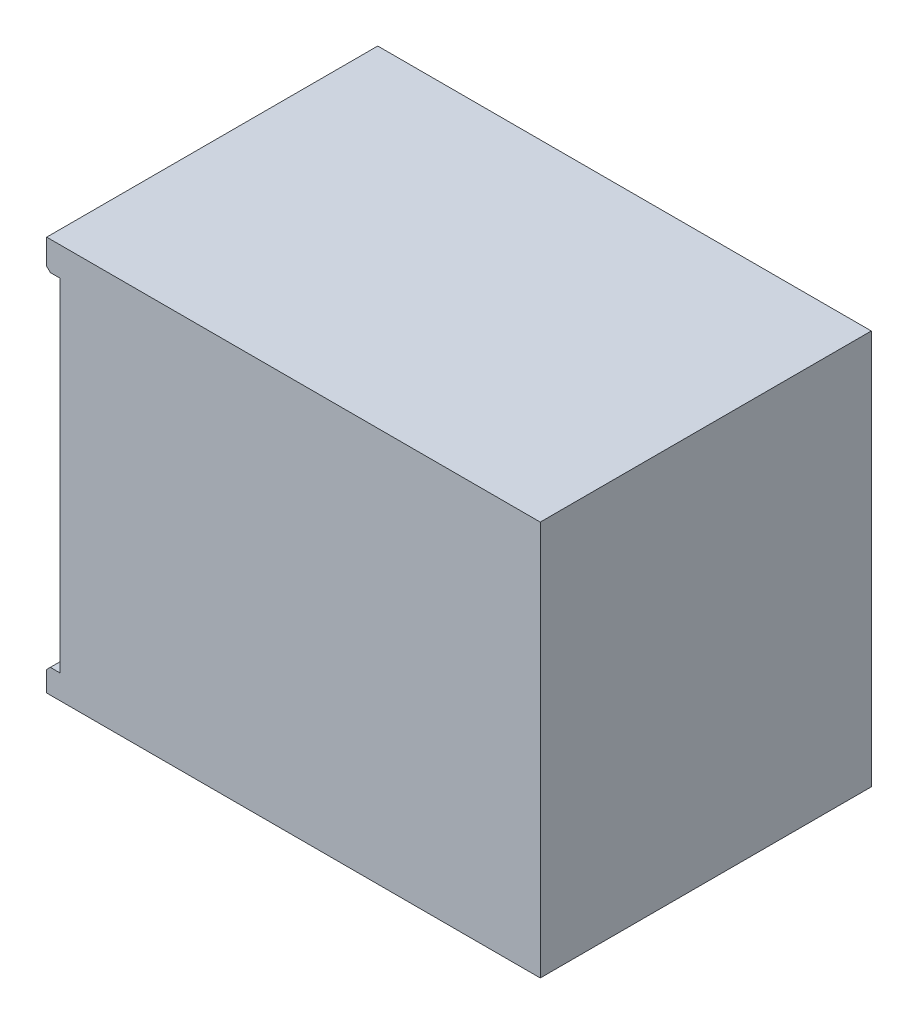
ISO-10303-21;
HEADER;
FILE_DESCRIPTION(('STEP AP214'),'2;1');
FILE_NAME('part.step','',(''),(''),'','','');
FILE_SCHEMA(('AUTOMOTIVE_DESIGN { 1 0 10303 214 1 1 1 1 }'));
ENDSEC;
DATA;
#1=APPLICATION_CONTEXT('core data for automotive mechanical design processes');
#2=APPLICATION_PROTOCOL_DEFINITION('international standard','automotive_design',2000,#1);
#3=PRODUCT_CONTEXT('',#1,'mechanical');
#4=PRODUCT('Part','Part','',(#3));
#5=PRODUCT_RELATED_PRODUCT_CATEGORY('part','',(#4));
#6=PRODUCT_DEFINITION_FORMATION('','',#4);
#7=PRODUCT_DEFINITION_CONTEXT('part definition',#1,'design');
#8=PRODUCT_DEFINITION('design','',#6,#7);
#9=PRODUCT_DEFINITION_SHAPE('','',#8);
#10=(LENGTH_UNIT() NAMED_UNIT(*) SI_UNIT(.MILLI.,.METRE.));
#11=(NAMED_UNIT(*) PLANE_ANGLE_UNIT() SI_UNIT($,.RADIAN.));
#12=(NAMED_UNIT(*) SI_UNIT($,.STERADIAN.) SOLID_ANGLE_UNIT());
#13=UNCERTAINTY_MEASURE_WITH_UNIT(LENGTH_MEASURE(1.E-05),#10,'distance_accuracy_value','');
#14=(GEOMETRIC_REPRESENTATION_CONTEXT(3) GLOBAL_UNCERTAINTY_ASSIGNED_CONTEXT((#13)) GLOBAL_UNIT_ASSIGNED_CONTEXT((#10,
#11,#12)) REPRESENTATION_CONTEXT('',''));
#15=CARTESIAN_POINT('',(0.,0.,0.));
#16=DIRECTION('',(0.,0.,1.));
#17=DIRECTION('',(1.,0.,0.));
#18=AXIS2_PLACEMENT_3D('',#15,#16,#17);
#19=CARTESIAN_POINT('',(-1.397,0.,17.4625));
#20=DIRECTION('',(0.,-1.,0.));
#21=DIRECTION('',(0.,0.,-1.));
#22=AXIS2_PLACEMENT_3D('',#19,#20,#21);
#23=PLANE('',#22);
#24=DIRECTION('',(-1.,0.,0.));
#25=VECTOR('',#24,1.);
#26=CARTESIAN_POINT('',(-1.397,0.,-17.4625));
#27=LINE('',#26,#25);
#28=CARTESIAN_POINT('',(50.673,0.,-17.4625));
#29=VERTEX_POINT('',#28);
#30=CARTESIAN_POINT('',(-1.397,0.,-17.4625));
#31=VERTEX_POINT('',#30);
#32=EDGE_CURVE('E150',#29,#31,#27,.T.);
#33=ORIENTED_EDGE('',*,*,#32,.T.);
#34=DIRECTION('',(0.,0.,-1.));
#35=VECTOR('',#34,1.);
#36=CARTESIAN_POINT('',(-1.397,0.,17.4625));
#37=LINE('',#36,#35);
#38=CARTESIAN_POINT('',(-1.397,0.,17.4625));
#39=VERTEX_POINT('',#38);
#40=EDGE_CURVE('E201',#39,#31,#37,.T.);
#41=ORIENTED_EDGE('',*,*,#40,.F.);
#42=DIRECTION('',(-1.,0.,0.));
#43=VECTOR('',#42,1.);
#44=CARTESIAN_POINT('',(-1.397,0.,17.4625));
#45=LINE('',#44,#43);
#46=CARTESIAN_POINT('',(50.673,0.,17.4625));
#47=VERTEX_POINT('',#46);
#48=EDGE_CURVE('E151',#47,#39,#45,.T.);
#49=ORIENTED_EDGE('',*,*,#48,.F.);
#50=DIRECTION('',(0.,0.,-1.));
#51=VECTOR('',#50,1.);
#52=CARTESIAN_POINT('',(50.673,0.,17.4625));
#53=LINE('',#52,#51);
#54=EDGE_CURVE('E170',#47,#29,#53,.T.);
#55=ORIENTED_EDGE('',*,*,#54,.T.);
#56=EDGE_LOOP('',(#33,#41,#49,#55));
#57=FACE_BOUND('',#56,.T.);
#58=ADVANCED_FACE('F37',(#57),#23,.F.);
#59=CARTESIAN_POINT('',(-1.397,-3.048,17.4625));
#60=DIRECTION('',(1.,0.,0.));
#61=DIRECTION('',(0.,0.,-1.));
#62=AXIS2_PLACEMENT_3D('',#59,#60,#61);
#63=PLANE('',#62);
#64=DIRECTION('',(0.,-1.,0.));
#65=VECTOR('',#64,1.);
#66=CARTESIAN_POINT('',(-1.397,-3.048,-17.4625));
#67=LINE('',#66,#65);
#68=CARTESIAN_POINT('',(-1.397,-2.667,-17.4625));
#69=VERTEX_POINT('',#68);
#70=EDGE_CURVE('E173',#31,#69,#67,.T.);
#71=ORIENTED_EDGE('',*,*,#70,.T.);
#72=DIRECTION('',(0.,0.,1.));
#73=VECTOR('',#72,1.);
#74=CARTESIAN_POINT('',(-1.397,-2.667,17.4625));
#75=LINE('',#74,#73);
#76=CARTESIAN_POINT('',(-1.397,-2.667,17.4625));
#77=VERTEX_POINT('',#76);
#78=EDGE_CURVE('E11',#69,#77,#75,.T.);
#79=ORIENTED_EDGE('',*,*,#78,.T.);
#80=DIRECTION('',(0.,-1.,0.));
#81=VECTOR('',#80,1.);
#82=CARTESIAN_POINT('',(-1.397,-3.048,17.4625));
#83=LINE('',#82,#81);
#84=EDGE_CURVE('E154',#39,#77,#83,.T.);
#85=ORIENTED_EDGE('',*,*,#84,.F.);
#86=ORIENTED_EDGE('',*,*,#40,.T.);
#87=EDGE_LOOP('',(#71,#79,#85,#86));
#88=FACE_BOUND('',#87,.T.);
#89=ADVANCED_FACE('F257',(#88),#63,.F.);
#90=CARTESIAN_POINT('',(0.,-3.048,17.4625));
#91=DIRECTION('',(0.,1.,0.));
#92=DIRECTION('',(0.,0.,1.));
#93=AXIS2_PLACEMENT_3D('',#90,#91,#92);
#94=PLANE('',#93);
#95=DIRECTION('',(1.,0.,0.));
#96=VECTOR('',#95,1.);
#97=CARTESIAN_POINT('',(0.,-3.048,17.4625));
#98=LINE('',#97,#96);
#99=CARTESIAN_POINT('',(-1.016,-3.048,17.4625));
#100=VERTEX_POINT('',#99);
#101=CARTESIAN_POINT('',(0.,-3.048,17.4625));
#102=VERTEX_POINT('',#101);
#103=EDGE_CURVE('E157',#100,#102,#98,.T.);
#104=ORIENTED_EDGE('',*,*,#103,.F.);
#105=DIRECTION('',(0.,0.,-1.));
#106=VECTOR('',#105,1.);
#107=CARTESIAN_POINT('',(-1.016,-3.048,17.4625));
#108=LINE('',#107,#106);
#109=CARTESIAN_POINT('',(-1.016,-3.048,-17.4625));
#110=VERTEX_POINT('',#109);
#111=EDGE_CURVE('E45',#100,#110,#108,.T.);
#112=ORIENTED_EDGE('',*,*,#111,.T.);
#113=DIRECTION('',(1.,0.,0.));
#114=VECTOR('',#113,1.);
#115=CARTESIAN_POINT('',(0.,-3.048,-17.4625));
#116=LINE('',#115,#114);
#117=CARTESIAN_POINT('',(0.,-3.048,-17.4625));
#118=VERTEX_POINT('',#117);
#119=EDGE_CURVE('E175',#110,#118,#116,.T.);
#120=ORIENTED_EDGE('',*,*,#119,.T.);
#121=DIRECTION('',(0.,0.,-1.));
#122=VECTOR('',#121,1.);
#123=CARTESIAN_POINT('',(0.,-3.048,17.4625));
#124=LINE('',#123,#122);
#125=EDGE_CURVE('E198',#102,#118,#124,.T.);
#126=ORIENTED_EDGE('',*,*,#125,.F.);
#127=EDGE_LOOP('',(#104,#112,#120,#126));
#128=FACE_BOUND('',#127,.T.);
#129=ADVANCED_FACE('F219',(#128),#94,.F.);
#130=CARTESIAN_POINT('',(0.,-39.116,17.4625));
#131=DIRECTION('',(1.,0.,0.));
#132=DIRECTION('',(0.,0.,-1.));
#133=AXIS2_PLACEMENT_3D('',#130,#131,#132);
#134=PLANE('',#133);
#135=CARTESIAN_POINT('',(0.,-29.21,-13.97));
#136=DIRECTION('',(-1.,0.,0.));
#137=DIRECTION('',(0.,0.,1.));
#138=AXIS2_PLACEMENT_3D('',#135,#136,#137);
#139=CIRCLE('',#138,1.7526);
#140=CARTESIAN_POINT('',(0.,-29.21,-12.2174));
#141=VERTEX_POINT('',#140);
#142=EDGE_CURVE('E135',#141,#141,#139,.T.);
#143=ORIENTED_EDGE('',*,*,#142,.F.);
#144=EDGE_LOOP('',(#143));
#145=FACE_BOUND('',#144,.T.);
#146=CARTESIAN_POINT('',(0.,-12.446,13.97));
#147=DIRECTION('',(-1.,0.,0.));
#148=DIRECTION('',(0.,0.,1.));
#149=AXIS2_PLACEMENT_3D('',#146,#147,#148);
#150=CIRCLE('',#149,1.7526);
#151=CARTESIAN_POINT('',(0.,-12.446,15.7226));
#152=VERTEX_POINT('',#151);
#153=EDGE_CURVE('E147',#152,#152,#150,.T.);
#154=ORIENTED_EDGE('',*,*,#153,.F.);
#155=EDGE_LOOP('',(#154));
#156=FACE_BOUND('',#155,.T.);
#157=DIRECTION('',(0.,-1.,0.));
#158=VECTOR('',#157,1.);
#159=CARTESIAN_POINT('',(0.,-39.116,-17.4625));
#160=LINE('',#159,#158);
#161=CARTESIAN_POINT('',(0.,-39.116,-17.4625));
#162=VERTEX_POINT('',#161);
#163=EDGE_CURVE('E177',#118,#162,#160,.T.);
#164=ORIENTED_EDGE('',*,*,#163,.T.);
#165=DIRECTION('',(0.,0.,-1.));
#166=VECTOR('',#165,1.);
#167=CARTESIAN_POINT('',(0.,-39.116,17.4625));
#168=LINE('',#167,#166);
#169=CARTESIAN_POINT('',(0.,-39.116,17.4625));
#170=VERTEX_POINT('',#169);
#171=EDGE_CURVE('E195',#170,#162,#168,.T.);
#172=ORIENTED_EDGE('',*,*,#171,.F.);
#173=DIRECTION('',(0.,-1.,0.));
#174=VECTOR('',#173,1.);
#175=CARTESIAN_POINT('',(0.,-39.116,17.4625));
#176=LINE('',#175,#174);
#177=EDGE_CURVE('E159',#102,#170,#176,.T.);
#178=ORIENTED_EDGE('',*,*,#177,.F.);
#179=ORIENTED_EDGE('',*,*,#125,.T.);
#180=EDGE_LOOP('',(#164,#172,#178,#179));
#181=FACE_BOUND('',#180,.T.);
#182=ADVANCED_FACE('F229',(#145,#156,#181),#134,.F.);
#183=CARTESIAN_POINT('',(-1.39700000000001,-39.116,17.4625));
#184=DIRECTION('',(0.,-1.,0.));
#185=DIRECTION('',(0.,0.,-1.));
#186=AXIS2_PLACEMENT_3D('',#183,#184,#185);
#187=PLANE('',#186);
#188=DIRECTION('',(-1.,0.,0.));
#189=VECTOR('',#188,1.);
#190=CARTESIAN_POINT('',(-1.39700000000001,-39.116,-17.4625));
#191=LINE('',#190,#189);
#192=CARTESIAN_POINT('',(-1.01600000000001,-39.116,-17.4625));
#193=VERTEX_POINT('',#192);
#194=EDGE_CURVE('E179',#162,#193,#191,.T.);
#195=ORIENTED_EDGE('',*,*,#194,.T.);
#196=DIRECTION('',(0.,0.,1.));
#197=VECTOR('',#196,1.);
#198=CARTESIAN_POINT('',(-1.01600000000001,-39.116,17.4625));
#199=LINE('',#198,#197);
#200=CARTESIAN_POINT('',(-1.01600000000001,-39.116,17.4625));
#201=VERTEX_POINT('',#200);
#202=EDGE_CURVE('E211',#193,#201,#199,.T.);
#203=ORIENTED_EDGE('',*,*,#202,.T.);
#204=DIRECTION('',(-1.,0.,0.));
#205=VECTOR('',#204,1.);
#206=CARTESIAN_POINT('',(-1.39700000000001,-39.116,17.4625));
#207=LINE('',#206,#205);
#208=EDGE_CURVE('E161',#170,#201,#207,.T.);
#209=ORIENTED_EDGE('',*,*,#208,.F.);
#210=ORIENTED_EDGE('',*,*,#171,.T.);
#211=EDGE_LOOP('',(#195,#203,#209,#210));
#212=FACE_BOUND('',#211,.T.);
#213=ADVANCED_FACE('F233',(#212),#187,.F.);
#214=CARTESIAN_POINT('',(-1.39700000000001,-41.656,17.4625));
#215=DIRECTION('',(1.,0.,0.));
#216=DIRECTION('',(0.,1.,0.));
#217=AXIS2_PLACEMENT_3D('',#214,#215,#216);
#218=PLANE('',#217);
#219=DIRECTION('',(0.,-1.,0.));
#220=VECTOR('',#219,1.);
#221=CARTESIAN_POINT('',(-1.39700000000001,-41.656,17.4625));
#222=LINE('',#221,#220);
#223=CARTESIAN_POINT('',(-1.39700000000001,-39.497,17.4625));
#224=VERTEX_POINT('',#223);
#225=CARTESIAN_POINT('',(-1.39700000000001,-41.656,17.4625));
#226=VERTEX_POINT('',#225);
#227=EDGE_CURVE('E164',#224,#226,#222,.T.);
#228=ORIENTED_EDGE('',*,*,#227,.F.);
#229=DIRECTION('',(0.,0.,-1.));
#230=VECTOR('',#229,1.);
#231=CARTESIAN_POINT('',(-1.39700000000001,-39.497,17.4625));
#232=LINE('',#231,#230);
#233=CARTESIAN_POINT('',(-1.39700000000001,-39.497,-17.4625));
#234=VERTEX_POINT('',#233);
#235=EDGE_CURVE('E204',#224,#234,#232,.T.);
#236=ORIENTED_EDGE('',*,*,#235,.T.);
#237=DIRECTION('',(0.,-1.,0.));
#238=VECTOR('',#237,1.);
#239=CARTESIAN_POINT('',(-1.39700000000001,-41.656,-17.4625));
#240=LINE('',#239,#238);
#241=CARTESIAN_POINT('',(-1.39700000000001,-41.656,-17.4625));
#242=VERTEX_POINT('',#241);
#243=EDGE_CURVE('E182',#234,#242,#240,.T.);
#244=ORIENTED_EDGE('',*,*,#243,.T.);
#245=DIRECTION('',(0.,0.,-1.));
#246=VECTOR('',#245,1.);
#247=CARTESIAN_POINT('',(-1.39700000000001,-41.656,17.4625));
#248=LINE('',#247,#246);
#249=EDGE_CURVE('E192',#226,#242,#248,.T.);
#250=ORIENTED_EDGE('',*,*,#249,.F.);
#251=EDGE_LOOP('',(#228,#236,#244,#250));
#252=FACE_BOUND('',#251,.T.);
#253=ADVANCED_FACE('F241',(#252),#218,.F.);
#254=CARTESIAN_POINT('',(50.673,-41.656,17.4625));
#255=DIRECTION('',(0.,1.,0.));
#256=DIRECTION('',(-1.,0.,0.));
#257=AXIS2_PLACEMENT_3D('',#254,#255,#256);
#258=PLANE('',#257);
#259=DIRECTION('',(1.,0.,0.));
#260=VECTOR('',#259,1.);
#261=CARTESIAN_POINT('',(50.673,-41.656,-17.4625));
#262=LINE('',#261,#260);
#263=CARTESIAN_POINT('',(50.673,-41.656,-17.4625));
#264=VERTEX_POINT('',#263);
#265=EDGE_CURVE('E184',#242,#264,#262,.T.);
#266=ORIENTED_EDGE('',*,*,#265,.T.);
#267=DIRECTION('',(0.,0.,-1.));
#268=VECTOR('',#267,1.);
#269=CARTESIAN_POINT('',(50.673,-41.656,17.4625));
#270=LINE('',#269,#268);
#271=CARTESIAN_POINT('',(50.673,-41.656,17.4625));
#272=VERTEX_POINT('',#271);
#273=EDGE_CURVE('E189',#272,#264,#270,.T.);
#274=ORIENTED_EDGE('',*,*,#273,.F.);
#275=DIRECTION('',(1.,0.,0.));
#276=VECTOR('',#275,1.);
#277=CARTESIAN_POINT('',(50.673,-41.656,17.4625));
#278=LINE('',#277,#276);
#279=EDGE_CURVE('E166',#226,#272,#278,.T.);
#280=ORIENTED_EDGE('',*,*,#279,.F.);
#281=ORIENTED_EDGE('',*,*,#249,.T.);
#282=EDGE_LOOP('',(#266,#274,#280,#281));
#283=FACE_BOUND('',#282,.T.);
#284=ADVANCED_FACE('F248',(#283),#258,.F.);
#285=CARTESIAN_POINT('',(50.673,0.,17.4625));
#286=DIRECTION('',(-1.,0.,0.));
#287=DIRECTION('',(0.,0.,1.));
#288=AXIS2_PLACEMENT_3D('',#285,#286,#287);
#289=PLANE('',#288);
#290=DIRECTION('',(0.,1.,0.));
#291=VECTOR('',#290,1.);
#292=CARTESIAN_POINT('',(50.673,0.,-17.4625));
#293=LINE('',#292,#291);
#294=EDGE_CURVE('E155',#264,#29,#293,.T.);
#295=ORIENTED_EDGE('',*,*,#294,.T.);
#296=ORIENTED_EDGE('',*,*,#54,.F.);
#297=DIRECTION('',(0.,1.,0.));
#298=VECTOR('',#297,1.);
#299=CARTESIAN_POINT('',(50.673,0.,17.4625));
#300=LINE('',#299,#298);
#301=EDGE_CURVE('E168',#272,#47,#300,.T.);
#302=ORIENTED_EDGE('',*,*,#301,.F.);
#303=ORIENTED_EDGE('',*,*,#273,.T.);
#304=EDGE_LOOP('',(#295,#296,#302,#303));
#305=FACE_BOUND('',#304,.T.);
#306=ADVANCED_FACE('F252',(#305),#289,.F.);
#307=CARTESIAN_POINT('',(50.673,0.,17.4625));
#308=DIRECTION('',(0.,0.,-1.));
#309=DIRECTION('',(-1.,0.,0.));
#310=AXIS2_PLACEMENT_3D('',#307,#308,#309);
#311=PLANE('',#310);
#312=ORIENTED_EDGE('',*,*,#208,.T.);
#313=DIRECTION('',(0.707106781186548,0.707106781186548,0.));
#314=VECTOR('',#313,1.);
#315=CARTESIAN_POINT('',(-1.39700000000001,-39.497,17.4625));
#316=LINE('',#315,#314);
#317=EDGE_CURVE('E214',#201,#224,#316,.F.);
#318=ORIENTED_EDGE('',*,*,#317,.T.);
#319=ORIENTED_EDGE('',*,*,#227,.T.);
#320=ORIENTED_EDGE('',*,*,#279,.T.);
#321=ORIENTED_EDGE('',*,*,#301,.T.);
#322=ORIENTED_EDGE('',*,*,#48,.T.);
#323=ORIENTED_EDGE('',*,*,#84,.T.);
#324=DIRECTION('',(-0.707106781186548,0.707106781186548,0.));
#325=VECTOR('',#324,1.);
#326=CARTESIAN_POINT('',(-1.016,-3.048,17.4625));
#327=LINE('',#326,#325);
#328=EDGE_CURVE('E52',#77,#100,#327,.F.);
#329=ORIENTED_EDGE('',*,*,#328,.T.);
#330=ORIENTED_EDGE('',*,*,#103,.T.);
#331=ORIENTED_EDGE('',*,*,#177,.T.);
#332=EDGE_LOOP('',(#312,#318,#319,#320,#321,#322,#323,#329,#330,#331));
#333=FACE_BOUND('',#332,.T.);
#334=ADVANCED_FACE('F236',(#333),#311,.F.);
#335=CARTESIAN_POINT('',(50.673,0.,-17.4625));
#336=DIRECTION('',(0.,0.,-1.));
#337=DIRECTION('',(-1.,0.,0.));
#338=AXIS2_PLACEMENT_3D('',#335,#336,#337);
#339=PLANE('',#338);
#340=ORIENTED_EDGE('',*,*,#243,.F.);
#341=DIRECTION('',(-0.707106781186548,-0.707106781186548,0.));
#342=VECTOR('',#341,1.);
#343=CARTESIAN_POINT('',(44.3865,6.2865,-17.4625));
#344=LINE('',#343,#342);
#345=EDGE_CURVE('E209',#234,#193,#344,.F.);
#346=ORIENTED_EDGE('',*,*,#345,.T.);
#347=ORIENTED_EDGE('',*,*,#194,.F.);
#348=ORIENTED_EDGE('',*,*,#163,.F.);
#349=ORIENTED_EDGE('',*,*,#119,.F.);
#350=DIRECTION('',(0.707106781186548,-0.707106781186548,0.));
#351=VECTOR('',#350,1.);
#352=CARTESIAN_POINT('',(23.3045,-27.3685,-17.4625));
#353=LINE('',#352,#351);
#354=EDGE_CURVE('E207',#110,#69,#353,.F.);
#355=ORIENTED_EDGE('',*,*,#354,.T.);
#356=ORIENTED_EDGE('',*,*,#70,.F.);
#357=ORIENTED_EDGE('',*,*,#32,.F.);
#358=ORIENTED_EDGE('',*,*,#294,.F.);
#359=ORIENTED_EDGE('',*,*,#265,.F.);
#360=EDGE_LOOP('',(#340,#346,#347,#348,#349,#355,#356,#357,#358,#359));
#361=FACE_BOUND('',#360,.T.);
#362=ADVANCED_FACE('F225',(#361),#339,.T.);
#363=CARTESIAN_POINT('',(0.,-12.446,13.97));
#364=DIRECTION('',(-1.,0.,0.));
#365=DIRECTION('',(0.,0.,1.));
#366=AXIS2_PLACEMENT_3D('',#363,#364,#365);
#367=CYLINDRICAL_SURFACE('',#366,1.7526);
#368=CARTESIAN_POINT('',(7.62,-12.446,13.97));
#369=DIRECTION('',(-1.,0.,0.));
#370=DIRECTION('',(0.,0.,1.));
#371=AXIS2_PLACEMENT_3D('',#368,#369,#370);
#372=CIRCLE('',#371,1.7526);
#373=CARTESIAN_POINT('',(7.62,-12.446,15.7226));
#374=VERTEX_POINT('',#373);
#375=EDGE_CURVE('E144',#374,#374,#372,.T.);
#376=ORIENTED_EDGE('',*,*,#375,.F.);
#377=EDGE_LOOP('',(#376));
#378=FACE_BOUND('',#377,.T.);
#379=ORIENTED_EDGE('',*,*,#153,.T.);
#380=EDGE_LOOP('',(#379));
#381=FACE_BOUND('',#380,.T.);
#382=ADVANCED_FACE('F284',(#378,#381),#367,.F.);
#383=CARTESIAN_POINT('',(7.62,-11.09345,13.97));
#384=DIRECTION('',(1.,0.,0.));
#385=DIRECTION('',(0.,0.,-1.));
#386=AXIS2_PLACEMENT_3D('',#383,#384,#385);
#387=PLANE('',#386);
#388=CARTESIAN_POINT('',(7.62,-12.446,13.97));
#389=DIRECTION('',(-1.,0.,0.));
#390=DIRECTION('',(0.,0.,1.));
#391=AXIS2_PLACEMENT_3D('',#388,#389,#390);
#392=CIRCLE('',#391,1.35255);
#393=CARTESIAN_POINT('',(7.62,-12.446,15.32255));
#394=VERTEX_POINT('',#393);
#395=EDGE_CURVE('E141',#394,#394,#392,.T.);
#396=ORIENTED_EDGE('',*,*,#395,.F.);
#397=EDGE_LOOP('',(#396));
#398=FACE_BOUND('',#397,.T.);
#399=ORIENTED_EDGE('',*,*,#375,.T.);
#400=EDGE_LOOP('',(#399));
#401=FACE_BOUND('',#400,.T.);
#402=ADVANCED_FACE('F289',(#398,#401),#387,.F.);
#403=CARTESIAN_POINT('',(0.,-12.446,13.97));
#404=DIRECTION('',(-1.,0.,0.));
#405=DIRECTION('',(0.,0.,1.));
#406=AXIS2_PLACEMENT_3D('',#403,#404,#405);
#407=CYLINDRICAL_SURFACE('',#406,1.35255);
#408=CARTESIAN_POINT('',(9.99744,-12.446,13.97));
#409=DIRECTION('',(-1.,0.,0.));
#410=DIRECTION('',(0.,0.,1.));
#411=AXIS2_PLACEMENT_3D('',#408,#409,#410);
#412=CIRCLE('',#411,1.35255);
#413=CARTESIAN_POINT('',(9.99744,-12.446,15.32255));
#414=VERTEX_POINT('',#413);
#415=EDGE_CURVE('E138',#414,#414,#412,.T.);
#416=ORIENTED_EDGE('',*,*,#415,.F.);
#417=EDGE_LOOP('',(#416));
#418=FACE_BOUND('',#417,.T.);
#419=ORIENTED_EDGE('',*,*,#395,.T.);
#420=EDGE_LOOP('',(#419));
#421=FACE_BOUND('',#420,.T.);
#422=ADVANCED_FACE('F293',(#418,#421),#407,.F.);
#423=CARTESIAN_POINT('',(9.99744,-12.446,13.97));
#424=DIRECTION('',(-1.,0.,0.));
#425=DIRECTION('',(0.,0.,1.));
#426=AXIS2_PLACEMENT_3D('',#423,#424,#425);
#427=CONICAL_SURFACE('',#426,1.35255,1.02974425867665);
#428=CARTESIAN_POINT('',(10.8101340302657,-12.446,13.97));
#429=VERTEX_POINT('',#428);
#430=VERTEX_LOOP('',#429);
#431=FACE_BOUND('',#430,.T.);
#432=ORIENTED_EDGE('',*,*,#415,.T.);
#433=EDGE_LOOP('',(#432));
#434=FACE_BOUND('',#433,.T.);
#435=ADVANCED_FACE('F297',(#431,#434),#427,.F.);
#436=CARTESIAN_POINT('',(0.,-29.21,-13.97));
#437=DIRECTION('',(-1.,0.,0.));
#438=DIRECTION('',(0.,0.,1.));
#439=AXIS2_PLACEMENT_3D('',#436,#437,#438);
#440=CYLINDRICAL_SURFACE('',#439,1.7526);
#441=CARTESIAN_POINT('',(7.62,-29.21,-13.97));
#442=DIRECTION('',(-1.,0.,0.));
#443=DIRECTION('',(0.,0.,1.));
#444=AXIS2_PLACEMENT_3D('',#441,#442,#443);
#445=CIRCLE('',#444,1.7526);
#446=CARTESIAN_POINT('',(7.62,-29.21,-12.2174));
#447=VERTEX_POINT('',#446);
#448=EDGE_CURVE('E130',#447,#447,#445,.T.);
#449=ORIENTED_EDGE('',*,*,#448,.F.);
#450=EDGE_LOOP('',(#449));
#451=FACE_BOUND('',#450,.T.);
#452=ORIENTED_EDGE('',*,*,#142,.T.);
#453=EDGE_LOOP('',(#452));
#454=FACE_BOUND('',#453,.T.);
#455=ADVANCED_FACE('F301',(#451,#454),#440,.F.);
#456=CARTESIAN_POINT('',(7.62,-27.85745,-13.97));
#457=DIRECTION('',(1.,0.,0.));
#458=DIRECTION('',(0.,0.,-1.));
#459=AXIS2_PLACEMENT_3D('',#456,#457,#458);
#460=PLANE('',#459);
#461=CARTESIAN_POINT('',(7.62,-29.21,-13.97));
#462=DIRECTION('',(-1.,0.,0.));
#463=DIRECTION('',(0.,0.,1.));
#464=AXIS2_PLACEMENT_3D('',#461,#462,#463);
#465=CIRCLE('',#464,1.35255);
#466=CARTESIAN_POINT('',(7.62,-29.21,-12.61745));
#467=VERTEX_POINT('',#466);
#468=EDGE_CURVE('E127',#467,#467,#465,.T.);
#469=ORIENTED_EDGE('',*,*,#468,.F.);
#470=EDGE_LOOP('',(#469));
#471=FACE_BOUND('',#470,.T.);
#472=ORIENTED_EDGE('',*,*,#448,.T.);
#473=EDGE_LOOP('',(#472));
#474=FACE_BOUND('',#473,.T.);
#475=ADVANCED_FACE('F305',(#471,#474),#460,.F.);
#476=CARTESIAN_POINT('',(0.,-29.21,-13.97));
#477=DIRECTION('',(-1.,0.,0.));
#478=DIRECTION('',(0.,0.,1.));
#479=AXIS2_PLACEMENT_3D('',#476,#477,#478);
#480=CYLINDRICAL_SURFACE('',#479,1.35255);
#481=CARTESIAN_POINT('',(9.99744,-29.21,-13.97));
#482=DIRECTION('',(-1.,0.,0.));
#483=DIRECTION('',(0.,0.,1.));
#484=AXIS2_PLACEMENT_3D('',#481,#482,#483);
#485=CIRCLE('',#484,1.35255);
#486=CARTESIAN_POINT('',(9.99744,-29.21,-12.61745));
#487=VERTEX_POINT('',#486);
#488=EDGE_CURVE('E125',#487,#487,#485,.T.);
#489=ORIENTED_EDGE('',*,*,#488,.F.);
#490=EDGE_LOOP('',(#489));
#491=FACE_BOUND('',#490,.T.);
#492=ORIENTED_EDGE('',*,*,#468,.T.);
#493=EDGE_LOOP('',(#492));
#494=FACE_BOUND('',#493,.T.);
#495=ADVANCED_FACE('F121',(#491,#494),#480,.F.);
#496=CARTESIAN_POINT('',(9.99744,-29.21,-13.97));
#497=DIRECTION('',(-1.,0.,0.));
#498=DIRECTION('',(0.,0.,1.));
#499=AXIS2_PLACEMENT_3D('',#496,#497,#498);
#500=CONICAL_SURFACE('',#499,1.35255,1.02974425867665);
#501=CARTESIAN_POINT('',(10.8101340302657,-29.21,-13.97));
#502=VERTEX_POINT('',#501);
#503=VERTEX_LOOP('',#502);
#504=FACE_BOUND('',#503,.T.);
#505=ORIENTED_EDGE('',*,*,#488,.T.);
#506=EDGE_LOOP('',(#505));
#507=FACE_BOUND('',#506,.T.);
#508=ADVANCED_FACE('F117',(#504,#507),#500,.F.);
#509=CARTESIAN_POINT('',(-1.39700000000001,-39.497,17.4625));
#510=DIRECTION('',(0.707106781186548,-0.707106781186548,0.));
#511=DIRECTION('',(0.707106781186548,0.707106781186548,0.));
#512=AXIS2_PLACEMENT_3D('',#509,#510,#511);
#513=PLANE('',#512);
#514=ORIENTED_EDGE('',*,*,#317,.F.);
#515=ORIENTED_EDGE('',*,*,#202,.F.);
#516=ORIENTED_EDGE('',*,*,#345,.F.);
#517=ORIENTED_EDGE('',*,*,#235,.F.);
#518=EDGE_LOOP('',(#514,#515,#516,#517));
#519=FACE_BOUND('',#518,.T.);
#520=ADVANCED_FACE('F120',(#519),#513,.F.);
#521=CARTESIAN_POINT('',(-1.016,-3.048,17.4625));
#522=DIRECTION('',(0.707106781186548,0.707106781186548,0.));
#523=DIRECTION('',(-0.707106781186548,0.707106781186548,0.));
#524=AXIS2_PLACEMENT_3D('',#521,#522,#523);
#525=PLANE('',#524);
#526=ORIENTED_EDGE('',*,*,#328,.F.);
#527=ORIENTED_EDGE('',*,*,#78,.F.);
#528=ORIENTED_EDGE('',*,*,#354,.F.);
#529=ORIENTED_EDGE('',*,*,#111,.F.);
#530=EDGE_LOOP('',(#526,#527,#528,#529));
#531=FACE_BOUND('',#530,.T.);
#532=ADVANCED_FACE('F39',(#531),#525,.F.);
#533=CLOSED_SHELL('',(#58,#89,#129,#182,#213,#253,#284,#306,#334,#362,#382,#402,#422,#435,#455,
#475,#495,#508,#520,#532));
#534=MANIFOLD_SOLID_BREP('B2',#533);
#535=ADVANCED_BREP_SHAPE_REPRESENTATION('',(#18,#534),#14);
#536=SHAPE_DEFINITION_REPRESENTATION(#9,#535);
ENDSEC;
END-ISO-10303-21;
